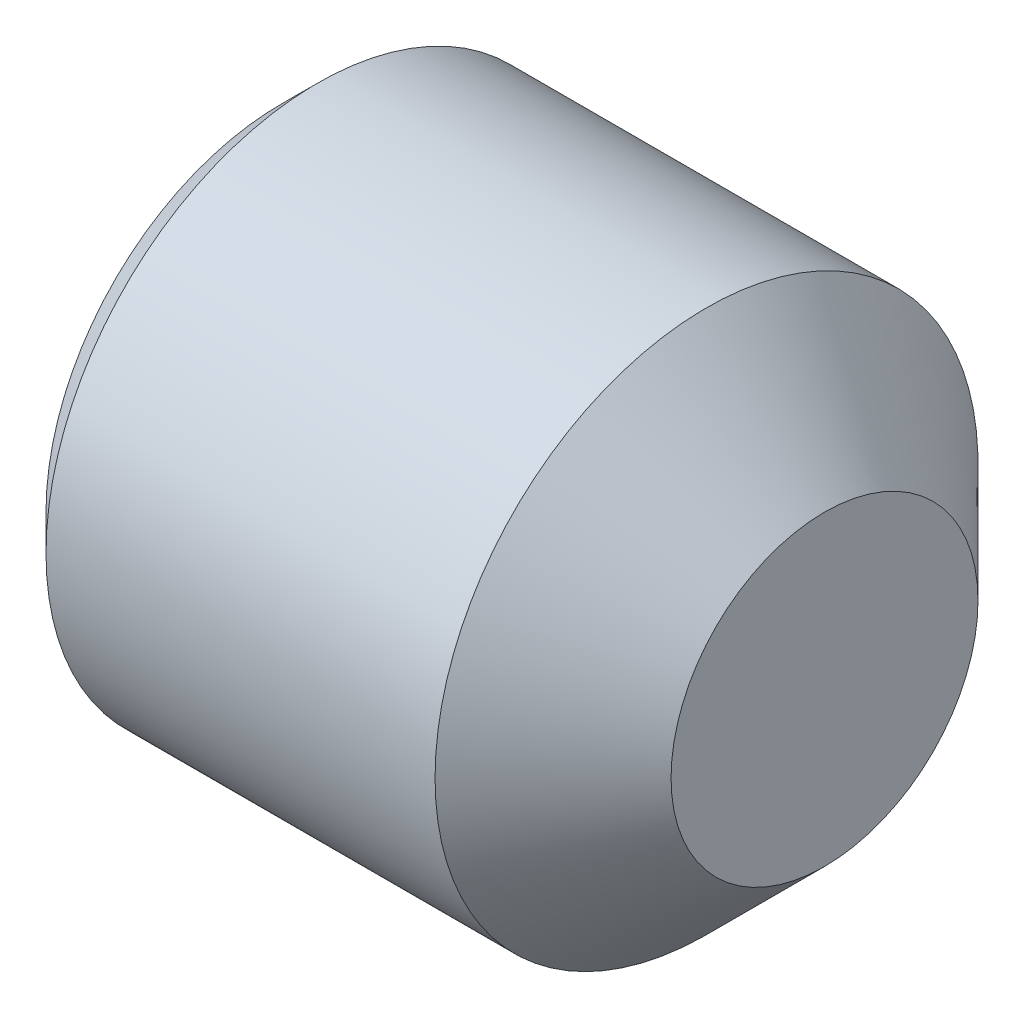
from build123d import *

# Parameters (mm, degrees)
HEX_2_DEPTH = 4.7752


with BuildPart() as part:
    # BodySke → BaseBody (revolve)
    with BuildSketch(Plane.XY, mode=Mode.PRIVATE) as basebody_sk:
        Polygon((0, 0), (0, 4.13258), (0.62992, 4.7625), (7.4549, 4.7625), (9.525, 2.6924), (9.525, 0), align=None)
    revolve(basebody_sk.sketch.rotate(Axis((-12.7, 0, 0), (1, 0, 0)), 90), axis=Axis((-12.7, 0, 0), (1, 0, 0)))

    # Sketch2 → Hex 2 (cut)
    with BuildSketch(Plane.ZY):
        Polygon((1.374815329, 2.38125), (-1.374815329, 2.38125), (-2.749630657, 0), (-1.374815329, -2.38125), (1.374815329, -2.38125), (2.749630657, 0), align=None)
    extrude(amount=-HEX_2_DEPTH, mode=Mode.SUBTRACT)


solid = part.part
